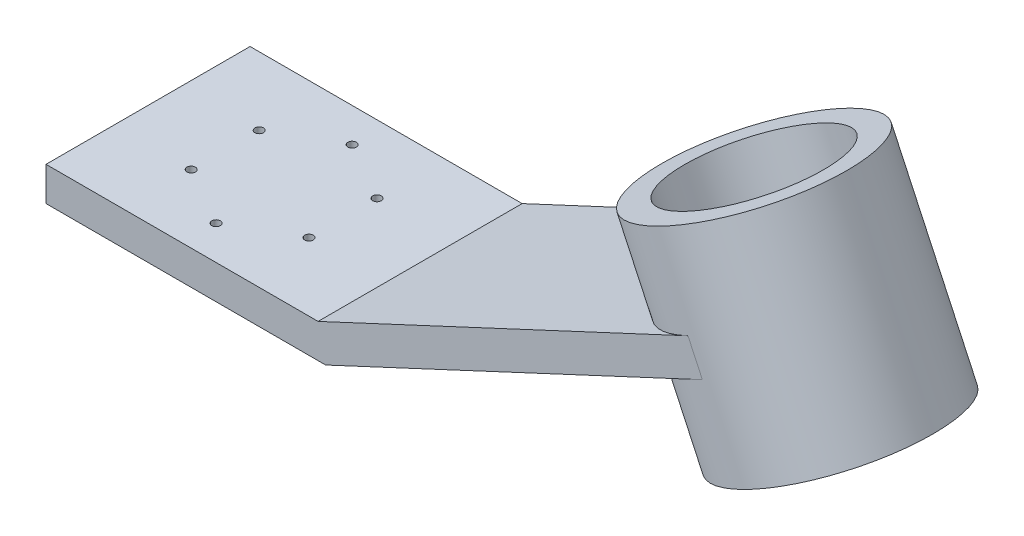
ISO-10303-21;
HEADER;
FILE_DESCRIPTION(('STEP AP214'),'2;1');
FILE_NAME('part.step','',(''),(''),'','','');
FILE_SCHEMA(('AUTOMOTIVE_DESIGN { 1 0 10303 214 1 1 1 1 }'));
ENDSEC;
DATA;
#1=APPLICATION_CONTEXT('core data for automotive mechanical design processes');
#2=APPLICATION_PROTOCOL_DEFINITION('international standard','automotive_design',2000,#1);
#3=PRODUCT_CONTEXT('',#1,'mechanical');
#4=PRODUCT('Part','Part','',(#3));
#5=PRODUCT_RELATED_PRODUCT_CATEGORY('part','',(#4));
#6=PRODUCT_DEFINITION_FORMATION('','',#4);
#7=PRODUCT_DEFINITION_CONTEXT('part definition',#1,'design');
#8=PRODUCT_DEFINITION('design','',#6,#7);
#9=PRODUCT_DEFINITION_SHAPE('','',#8);
#10=(LENGTH_UNIT() NAMED_UNIT(*) SI_UNIT(.MILLI.,.METRE.));
#11=(NAMED_UNIT(*) PLANE_ANGLE_UNIT() SI_UNIT($,.RADIAN.));
#12=(NAMED_UNIT(*) SI_UNIT($,.STERADIAN.) SOLID_ANGLE_UNIT());
#13=UNCERTAINTY_MEASURE_WITH_UNIT(LENGTH_MEASURE(1.E-05),#10,'distance_accuracy_value','');
#14=(GEOMETRIC_REPRESENTATION_CONTEXT(3) GLOBAL_UNCERTAINTY_ASSIGNED_CONTEXT((#13)) GLOBAL_UNIT_ASSIGNED_CONTEXT((#10,
#11,#12)) REPRESENTATION_CONTEXT('',''));
#15=CARTESIAN_POINT('',(0.,0.,0.));
#16=DIRECTION('',(0.,0.,1.));
#17=DIRECTION('',(1.,0.,0.));
#18=AXIS2_PLACEMENT_3D('',#15,#16,#17);
#19=CARTESIAN_POINT('',(4.22618261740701,-9.06307787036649,30.));
#20=DIRECTION('',(-0.422618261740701,0.906307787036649,0.));
#21=DIRECTION('',(-0.906307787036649,-0.422618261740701,0.));
#22=AXIS2_PLACEMENT_3D('',#19,#20,#21);
#23=PLANE('',#22);
#24=DIRECTION('',(0.906307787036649,0.422618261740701,0.));
#25=VECTOR('',#24,1.);
#26=CARTESIAN_POINT('',(4.22618261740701,-9.06307787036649,-30.));
#27=LINE('',#26,#25);
#28=CARTESIAN_POINT('',(2.21694662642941,-10.,-30.));
#29=VERTEX_POINT('',#28);
#30=CARTESIAN_POINT('',(112.983117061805,41.6511135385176,-30.));
#31=VERTEX_POINT('',#30);
#32=EDGE_CURVE('E174',#29,#31,#27,.T.);
#33=ORIENTED_EDGE('',*,*,#32,.T.);
#34=CARTESIAN_POINT('',(112.983117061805,41.6511135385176,0.));
#35=DIRECTION('',(-0.422618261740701,0.906307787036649,0.));
#36=DIRECTION('',(-0.906307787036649,-0.422618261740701,0.));
#37=AXIS2_PLACEMENT_3D('',#34,#35,#36);
#38=CIRCLE('',#37,30.);
#39=CARTESIAN_POINT('',(112.983117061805,41.6511135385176,30.));
#40=VERTEX_POINT('',#39);
#41=EDGE_CURVE('E171',#31,#40,#38,.T.);
#42=ORIENTED_EDGE('',*,*,#41,.T.);
#43=DIRECTION('',(0.906307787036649,0.422618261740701,0.));
#44=VECTOR('',#43,1.);
#45=CARTESIAN_POINT('',(4.22618261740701,-9.06307787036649,30.));
#46=LINE('',#45,#44);
#47=CARTESIAN_POINT('',(2.21694662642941,-10.,30.));
#48=VERTEX_POINT('',#47);
#49=EDGE_CURVE('E175',#48,#40,#46,.T.);
#50=ORIENTED_EDGE('',*,*,#49,.F.);
#51=DIRECTION('',(0.,0.,-1.));
#52=VECTOR('',#51,1.);
#53=CARTESIAN_POINT('',(2.21694662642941,-10.,30.));
#54=LINE('',#53,#52);
#55=EDGE_CURVE('E188',#48,#29,#54,.T.);
#56=ORIENTED_EDGE('',*,*,#55,.T.);
#57=EDGE_LOOP('',(#33,#42,#50,#56));
#58=FACE_BOUND('',#57,.T.);
#59=ADVANCED_FACE('F38',(#58),#23,.F.);
#60=CARTESIAN_POINT('',(0.,0.,30.));
#61=DIRECTION('',(-0.422618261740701,0.906307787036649,0.));
#62=DIRECTION('',(-0.906307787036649,-0.422618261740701,0.));
#63=AXIS2_PLACEMENT_3D('',#60,#61,#62);
#64=PLANE('',#63);
#65=CARTESIAN_POINT('',(108.756934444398,50.7141914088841,0.));
#66=DIRECTION('',(-0.422618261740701,0.906307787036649,0.));
#67=DIRECTION('',(-0.906307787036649,-0.422618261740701,0.));
#68=AXIS2_PLACEMENT_3D('',#65,#66,#67);
#69=CIRCLE('',#68,30.);
#70=CARTESIAN_POINT('',(108.756934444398,50.7141914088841,-30.));
#71=VERTEX_POINT('',#70);
#72=CARTESIAN_POINT('',(108.756934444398,50.7141914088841,30.));
#73=VERTEX_POINT('',#72);
#74=EDGE_CURVE('E169',#71,#73,#69,.T.);
#75=ORIENTED_EDGE('',*,*,#74,.F.);
#76=DIRECTION('',(0.906307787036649,0.422618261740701,0.));
#77=VECTOR('',#76,1.);
#78=CARTESIAN_POINT('',(0.,0.,-30.));
#79=LINE('',#78,#77);
#80=CARTESIAN_POINT('',(0.,0.,-30.));
#81=VERTEX_POINT('',#80);
#82=EDGE_CURVE('E194',#81,#71,#79,.T.);
#83=ORIENTED_EDGE('',*,*,#82,.F.);
#84=DIRECTION('',(0.,0.,-1.));
#85=VECTOR('',#84,1.);
#86=CARTESIAN_POINT('',(0.,0.,30.));
#87=LINE('',#86,#85);
#88=CARTESIAN_POINT('',(0.,0.,30.));
#89=VERTEX_POINT('',#88);
#90=EDGE_CURVE('E11',#89,#81,#87,.T.);
#91=ORIENTED_EDGE('',*,*,#90,.F.);
#92=DIRECTION('',(0.906307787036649,0.422618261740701,0.));
#93=VECTOR('',#92,1.);
#94=CARTESIAN_POINT('',(0.,0.,30.));
#95=LINE('',#94,#93);
#96=EDGE_CURVE('E179',#89,#73,#95,.T.);
#97=ORIENTED_EDGE('',*,*,#96,.T.);
#98=EDGE_LOOP('',(#75,#83,#91,#97));
#99=FACE_BOUND('',#98,.T.);
#100=ADVANCED_FACE('F221',(#99),#64,.T.);
#101=CARTESIAN_POINT('',(0.,0.,30.));
#102=DIRECTION('',(0.,1.,0.));
#103=DIRECTION('',(0.,0.,1.));
#104=AXIS2_PLACEMENT_3D('',#101,#102,#103);
#105=PLANE('',#104);
#106=CARTESIAN_POINT('',(-22.6794919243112,0.,-9.99999999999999));
#107=DIRECTION('',(0.,1.,0.));
#108=DIRECTION('',(0.,0.,1.));
#109=AXIS2_PLACEMENT_3D('',#106,#107,#108);
#110=CIRCLE('',#109,1.24999999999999);
#111=CARTESIAN_POINT('',(-22.6794919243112,0.,-8.75));
#112=VERTEX_POINT('',#111);
#113=EDGE_CURVE('E123',#112,#112,#110,.T.);
#114=ORIENTED_EDGE('',*,*,#113,.F.);
#115=EDGE_LOOP('',(#114));
#116=FACE_BOUND('',#115,.T.);
#117=CARTESIAN_POINT('',(-22.6794919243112,0.,10.));
#118=DIRECTION('',(0.,1.,0.));
#119=DIRECTION('',(0.,0.,1.));
#120=AXIS2_PLACEMENT_3D('',#117,#118,#119);
#121=CIRCLE('',#120,1.24999999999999);
#122=CARTESIAN_POINT('',(-22.6794919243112,0.,11.25));
#123=VERTEX_POINT('',#122);
#124=EDGE_CURVE('E122',#123,#123,#121,.T.);
#125=ORIENTED_EDGE('',*,*,#124,.F.);
#126=EDGE_LOOP('',(#125));
#127=FACE_BOUND('',#126,.T.);
#128=CARTESIAN_POINT('',(-40.,0.,20.));
#129=DIRECTION('',(0.,1.,0.));
#130=DIRECTION('',(0.,0.,1.));
#131=AXIS2_PLACEMENT_3D('',#128,#129,#130);
#132=CIRCLE('',#131,1.24999999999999);
#133=CARTESIAN_POINT('',(-40.,0.,21.25));
#134=VERTEX_POINT('',#133);
#135=EDGE_CURVE('E133',#134,#134,#132,.T.);
#136=ORIENTED_EDGE('',*,*,#135,.F.);
#137=EDGE_LOOP('',(#136));
#138=FACE_BOUND('',#137,.T.);
#139=CARTESIAN_POINT('',(-57.3205080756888,0.,9.99999999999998));
#140=DIRECTION('',(0.,1.,0.));
#141=DIRECTION('',(0.,0.,1.));
#142=AXIS2_PLACEMENT_3D('',#139,#140,#141);
#143=CIRCLE('',#142,1.24999999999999);
#144=CARTESIAN_POINT('',(-57.3205080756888,0.,11.25));
#145=VERTEX_POINT('',#144);
#146=EDGE_CURVE('E139',#145,#145,#143,.T.);
#147=ORIENTED_EDGE('',*,*,#146,.F.);
#148=EDGE_LOOP('',(#147));
#149=FACE_BOUND('',#148,.T.);
#150=CARTESIAN_POINT('',(-57.3205080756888,0.,-10.));
#151=DIRECTION('',(0.,1.,0.));
#152=DIRECTION('',(0.,0.,1.));
#153=AXIS2_PLACEMENT_3D('',#150,#151,#152);
#154=CIRCLE('',#153,1.24999999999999);
#155=CARTESIAN_POINT('',(-57.3205080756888,0.,-8.75000000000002));
#156=VERTEX_POINT('',#155);
#157=EDGE_CURVE('E145',#156,#156,#154,.T.);
#158=ORIENTED_EDGE('',*,*,#157,.F.);
#159=EDGE_LOOP('',(#158));
#160=FACE_BOUND('',#159,.T.);
#161=CARTESIAN_POINT('',(-40.,0.,-20.));
#162=DIRECTION('',(0.,1.,0.));
#163=DIRECTION('',(0.,0.,1.));
#164=AXIS2_PLACEMENT_3D('',#161,#162,#163);
#165=CIRCLE('',#164,1.24999999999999);
#166=CARTESIAN_POINT('',(-40.,0.,-18.75));
#167=VERTEX_POINT('',#166);
#168=EDGE_CURVE('E151',#167,#167,#165,.T.);
#169=ORIENTED_EDGE('',*,*,#168,.F.);
#170=EDGE_LOOP('',(#169));
#171=FACE_BOUND('',#170,.T.);
#172=DIRECTION('',(1.,0.,0.));
#173=VECTOR('',#172,1.);
#174=CARTESIAN_POINT('',(0.,0.,-30.));
#175=LINE('',#174,#173);
#176=CARTESIAN_POINT('',(-80.,0.,-30.));
#177=VERTEX_POINT('',#176);
#178=EDGE_CURVE('E197',#177,#81,#175,.T.);
#179=ORIENTED_EDGE('',*,*,#178,.F.);
#180=DIRECTION('',(0.,0.,-1.));
#181=VECTOR('',#180,1.);
#182=CARTESIAN_POINT('',(-80.,0.,30.));
#183=LINE('',#182,#181);
#184=CARTESIAN_POINT('',(-80.,0.,30.));
#185=VERTEX_POINT('',#184);
#186=EDGE_CURVE('E46',#185,#177,#183,.T.);
#187=ORIENTED_EDGE('',*,*,#186,.F.);
#188=DIRECTION('',(1.,0.,0.));
#189=VECTOR('',#188,1.);
#190=CARTESIAN_POINT('',(0.,0.,30.));
#191=LINE('',#190,#189);
#192=EDGE_CURVE('E181',#185,#89,#191,.T.);
#193=ORIENTED_EDGE('',*,*,#192,.T.);
#194=ORIENTED_EDGE('',*,*,#90,.T.);
#195=EDGE_LOOP('',(#179,#187,#193,#194));
#196=FACE_BOUND('',#195,.T.);
#197=ADVANCED_FACE('F211',(#116,#127,#138,#149,#160,#171,#196),#105,.T.);
#198=CARTESIAN_POINT('',(-80.,-10.,30.));
#199=DIRECTION('',(-1.,0.,0.));
#200=DIRECTION('',(0.,0.,1.));
#201=AXIS2_PLACEMENT_3D('',#198,#199,#200);
#202=PLANE('',#201);
#203=DIRECTION('',(0.,1.,0.));
#204=VECTOR('',#203,1.);
#205=CARTESIAN_POINT('',(-80.,-10.,-30.));
#206=LINE('',#205,#204);
#207=CARTESIAN_POINT('',(-80.,-10.,-30.));
#208=VERTEX_POINT('',#207);
#209=EDGE_CURVE('E200',#208,#177,#206,.T.);
#210=ORIENTED_EDGE('',*,*,#209,.F.);
#211=DIRECTION('',(0.,0.,-1.));
#212=VECTOR('',#211,1.);
#213=CARTESIAN_POINT('',(-80.,-10.,30.));
#214=LINE('',#213,#212);
#215=CARTESIAN_POINT('',(-80.,-10.,30.));
#216=VERTEX_POINT('',#215);
#217=EDGE_CURVE('E73',#216,#208,#214,.T.);
#218=ORIENTED_EDGE('',*,*,#217,.F.);
#219=DIRECTION('',(0.,1.,0.));
#220=VECTOR('',#219,1.);
#221=CARTESIAN_POINT('',(-80.,-10.,30.));
#222=LINE('',#221,#220);
#223=EDGE_CURVE('E184',#216,#185,#222,.T.);
#224=ORIENTED_EDGE('',*,*,#223,.T.);
#225=ORIENTED_EDGE('',*,*,#186,.T.);
#226=EDGE_LOOP('',(#210,#218,#224,#225));
#227=FACE_BOUND('',#226,.T.);
#228=ADVANCED_FACE('F208',(#227),#202,.T.);
#229=CARTESIAN_POINT('',(0.,-10.,30.));
#230=DIRECTION('',(0.,1.,0.));
#231=DIRECTION('',(0.,0.,1.));
#232=AXIS2_PLACEMENT_3D('',#229,#230,#231);
#233=PLANE('',#232);
#234=DIRECTION('',(1.,0.,0.));
#235=VECTOR('',#234,1.);
#236=CARTESIAN_POINT('',(0.,-10.,-30.));
#237=LINE('',#236,#235);
#238=EDGE_CURVE('E76',#208,#29,#237,.T.);
#239=ORIENTED_EDGE('',*,*,#238,.T.);
#240=ORIENTED_EDGE('',*,*,#55,.F.);
#241=DIRECTION('',(1.,0.,0.));
#242=VECTOR('',#241,1.);
#243=CARTESIAN_POINT('',(0.,-10.,30.));
#244=LINE('',#243,#242);
#245=EDGE_CURVE('E54',#216,#48,#244,.T.);
#246=ORIENTED_EDGE('',*,*,#245,.F.);
#247=ORIENTED_EDGE('',*,*,#217,.T.);
#248=EDGE_LOOP('',(#239,#240,#246,#247));
#249=FACE_BOUND('',#248,.T.);
#250=ADVANCED_FACE('F217',(#249),#233,.F.);
#251=CARTESIAN_POINT('',(0.,0.,30.));
#252=DIRECTION('',(0.,0.,-1.));
#253=DIRECTION('',(-1.,0.,0.));
#254=AXIS2_PLACEMENT_3D('',#251,#252,#253);
#255=PLANE('',#254);
#256=ORIENTED_EDGE('',*,*,#49,.T.);
#257=DIRECTION('',(0.422618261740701,-0.906307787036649,0.));
#258=VECTOR('',#257,1.);
#259=CARTESIAN_POINT('',(108.756934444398,50.7141914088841,30.));
#260=LINE('',#259,#258);
#261=EDGE_CURVE('E177',#73,#40,#260,.T.);
#262=ORIENTED_EDGE('',*,*,#261,.F.);
#263=ORIENTED_EDGE('',*,*,#96,.F.);
#264=ORIENTED_EDGE('',*,*,#192,.F.);
#265=ORIENTED_EDGE('',*,*,#223,.F.);
#266=ORIENTED_EDGE('',*,*,#245,.T.);
#267=EDGE_LOOP('',(#256,#262,#263,#264,#265,#266));
#268=FACE_BOUND('',#267,.T.);
#269=ADVANCED_FACE('F218',(#268),#255,.F.);
#270=CARTESIAN_POINT('',(0.,0.,-30.));
#271=DIRECTION('',(0.,0.,-1.));
#272=DIRECTION('',(-1.,0.,0.));
#273=AXIS2_PLACEMENT_3D('',#270,#271,#272);
#274=PLANE('',#273);
#275=ORIENTED_EDGE('',*,*,#32,.F.);
#276=ORIENTED_EDGE('',*,*,#238,.F.);
#277=ORIENTED_EDGE('',*,*,#209,.T.);
#278=ORIENTED_EDGE('',*,*,#178,.T.);
#279=ORIENTED_EDGE('',*,*,#82,.T.);
#280=DIRECTION('',(0.422618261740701,-0.906307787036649,0.));
#281=VECTOR('',#280,1.);
#282=CARTESIAN_POINT('',(108.756934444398,50.7141914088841,-30.));
#283=LINE('',#282,#281);
#284=EDGE_CURVE('E191',#71,#31,#283,.T.);
#285=ORIENTED_EDGE('',*,*,#284,.T.);
#286=EDGE_LOOP('',(#275,#276,#277,#278,#279,#285));
#287=FACE_BOUND('',#286,.T.);
#288=ADVANCED_FACE('F214',(#287),#274,.T.);
#289=CARTESIAN_POINT('',(123.548573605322,18.9934188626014,0.));
#290=DIRECTION('',(-0.422618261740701,0.906307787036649,0.));
#291=DIRECTION('',(-0.906307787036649,-0.422618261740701,0.));
#292=AXIS2_PLACEMENT_3D('',#289,#290,#291);
#293=CYLINDRICAL_SURFACE('',#292,30.);
#294=CARTESIAN_POINT('',(98.1914779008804,73.3718860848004,0.));
#295=DIRECTION('',(-0.422618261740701,0.906307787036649,0.));
#296=DIRECTION('',(-0.906307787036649,-0.422618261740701,0.));
#297=AXIS2_PLACEMENT_3D('',#294,#295,#296);
#298=CIRCLE('',#297,30.);
#299=CARTESIAN_POINT('',(71.0022442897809,60.6933382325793,0.));
#300=VERTEX_POINT('',#299);
#301=EDGE_CURVE('E163',#300,#300,#298,.T.);
#302=ORIENTED_EDGE('',*,*,#301,.F.);
#303=EDGE_LOOP('',(#302));
#304=FACE_BOUND('',#303,.T.);
#305=CARTESIAN_POINT('',(123.548573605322,18.9934188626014,0.));
#306=DIRECTION('',(-0.422618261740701,0.906307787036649,0.));
#307=DIRECTION('',(-0.906307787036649,-0.422618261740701,0.));
#308=AXIS2_PLACEMENT_3D('',#305,#306,#307);
#309=CIRCLE('',#308,30.);
#310=CARTESIAN_POINT('',(96.359339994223,6.31487101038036,0.));
#311=VERTEX_POINT('',#310);
#312=EDGE_CURVE('E166',#311,#311,#309,.T.);
#313=ORIENTED_EDGE('',*,*,#312,.T.);
#314=EDGE_LOOP('',(#313));
#315=FACE_BOUND('',#314,.T.);
#316=ORIENTED_EDGE('',*,*,#41,.F.);
#317=ORIENTED_EDGE('',*,*,#284,.F.);
#318=ORIENTED_EDGE('',*,*,#74,.T.);
#319=ORIENTED_EDGE('',*,*,#261,.T.);
#320=EDGE_LOOP('',(#316,#317,#318,#319));
#321=FACE_BOUND('',#320,.T.);
#322=ADVANCED_FACE('F223',(#304,#315,#321),#293,.T.);
#323=CARTESIAN_POINT('',(123.548573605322,18.9934188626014,0.));
#324=DIRECTION('',(-0.422618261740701,0.906307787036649,0.));
#325=DIRECTION('',(-0.906307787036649,-0.422618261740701,0.));
#326=AXIS2_PLACEMENT_3D('',#323,#324,#325);
#327=PLANE('',#326);
#328=CARTESIAN_POINT('',(123.548573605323,18.9934188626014,0.));
#329=DIRECTION('',(-0.422618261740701,0.906307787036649,0.));
#330=DIRECTION('',(-0.906307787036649,-0.422618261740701,0.));
#331=AXIS2_PLACEMENT_3D('',#328,#329,#330);
#332=CIRCLE('',#331,22.5);
#333=CARTESIAN_POINT('',(103.156648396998,9.48450797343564,0.));
#334=VERTEX_POINT('',#333);
#335=EDGE_CURVE('E160',#334,#334,#332,.T.);
#336=ORIENTED_EDGE('',*,*,#335,.T.);
#337=EDGE_LOOP('',(#336));
#338=FACE_BOUND('',#337,.T.);
#339=ORIENTED_EDGE('',*,*,#312,.F.);
#340=EDGE_LOOP('',(#339));
#341=FACE_BOUND('',#340,.T.);
#342=ADVANCED_FACE('F225',(#338,#341),#327,.F.);
#343=CARTESIAN_POINT('',(98.1914779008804,73.3718860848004,0.));
#344=DIRECTION('',(-0.422618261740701,0.906307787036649,0.));
#345=DIRECTION('',(-0.906307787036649,-0.422618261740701,0.));
#346=AXIS2_PLACEMENT_3D('',#343,#344,#345);
#347=PLANE('',#346);
#348=CARTESIAN_POINT('',(98.1914779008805,73.3718860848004,0.));
#349=DIRECTION('',(-0.422618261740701,0.906307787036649,0.));
#350=DIRECTION('',(-0.906307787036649,-0.422618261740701,0.));
#351=AXIS2_PLACEMENT_3D('',#348,#349,#350);
#352=CIRCLE('',#351,22.5);
#353=CARTESIAN_POINT('',(77.7995526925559,63.8629751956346,0.));
#354=VERTEX_POINT('',#353);
#355=EDGE_CURVE('E157',#354,#354,#352,.T.);
#356=ORIENTED_EDGE('',*,*,#355,.F.);
#357=EDGE_LOOP('',(#356));
#358=FACE_BOUND('',#357,.T.);
#359=ORIENTED_EDGE('',*,*,#301,.T.);
#360=EDGE_LOOP('',(#359));
#361=FACE_BOUND('',#360,.T.);
#362=ADVANCED_FACE('F232',(#358,#361),#347,.T.);
#363=CARTESIAN_POINT('',(139.509862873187,-15.2356764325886,0.));
#364=DIRECTION('',(-0.422618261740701,0.906307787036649,0.));
#365=DIRECTION('',(-0.906307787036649,-0.422618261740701,0.));
#366=AXIS2_PLACEMENT_3D('',#363,#364,#365);
#367=CYLINDRICAL_SURFACE('',#366,22.5);
#368=ORIENTED_EDGE('',*,*,#355,.T.);
#369=EDGE_LOOP('',(#368));
#370=FACE_BOUND('',#369,.T.);
#371=ORIENTED_EDGE('',*,*,#335,.F.);
#372=EDGE_LOOP('',(#371));
#373=FACE_BOUND('',#372,.T.);
#374=ADVANCED_FACE('F280',(#370,#373),#367,.F.);
#375=CARTESIAN_POINT('',(-40.,-8.49999999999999,-20.));
#376=DIRECTION('',(0.,1.,0.));
#377=DIRECTION('',(0.,0.,1.));
#378=AXIS2_PLACEMENT_3D('',#375,#376,#377);
#379=CONICAL_SURFACE('',#378,1.24999999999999,1.02974425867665);
#380=CARTESIAN_POINT('',(-40.,-9.25107577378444,-20.));
#381=VERTEX_POINT('',#380);
#382=VERTEX_LOOP('',#381);
#383=FACE_BOUND('',#382,.T.);
#384=CARTESIAN_POINT('',(-40.,-8.49999999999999,-20.));
#385=DIRECTION('',(0.,1.,0.));
#386=DIRECTION('',(0.,0.,1.));
#387=AXIS2_PLACEMENT_3D('',#384,#385,#386);
#388=CIRCLE('',#387,1.24999999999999);
#389=CARTESIAN_POINT('',(-40.,-8.49999999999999,-18.75));
#390=VERTEX_POINT('',#389);
#391=EDGE_CURVE('E154',#390,#390,#388,.T.);
#392=ORIENTED_EDGE('',*,*,#391,.T.);
#393=EDGE_LOOP('',(#392));
#394=FACE_BOUND('',#393,.T.);
#395=ADVANCED_FACE('F290',(#383,#394),#379,.F.);
#396=CARTESIAN_POINT('',(-40.,0.,-20.));
#397=DIRECTION('',(0.,1.,0.));
#398=DIRECTION('',(0.,0.,1.));
#399=AXIS2_PLACEMENT_3D('',#396,#397,#398);
#400=CYLINDRICAL_SURFACE('',#399,1.24999999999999);
#401=ORIENTED_EDGE('',*,*,#391,.F.);
#402=EDGE_LOOP('',(#401));
#403=FACE_BOUND('',#402,.T.);
#404=ORIENTED_EDGE('',*,*,#168,.T.);
#405=EDGE_LOOP('',(#404));
#406=FACE_BOUND('',#405,.T.);
#407=ADVANCED_FACE('F300',(#403,#406),#400,.F.);
#408=CARTESIAN_POINT('',(-57.3205080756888,-8.49999999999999,-10.));
#409=DIRECTION('',(0.,1.,0.));
#410=DIRECTION('',(0.,0.,1.));
#411=AXIS2_PLACEMENT_3D('',#408,#409,#410);
#412=CONICAL_SURFACE('',#411,1.24999999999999,1.02974425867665);
#413=CARTESIAN_POINT('',(-57.3205080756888,-9.25107577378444,-10.));
#414=VERTEX_POINT('',#413);
#415=VERTEX_LOOP('',#414);
#416=FACE_BOUND('',#415,.T.);
#417=CARTESIAN_POINT('',(-57.3205080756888,-8.49999999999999,-10.));
#418=DIRECTION('',(0.,1.,0.));
#419=DIRECTION('',(0.,0.,1.));
#420=AXIS2_PLACEMENT_3D('',#417,#418,#419);
#421=CIRCLE('',#420,1.24999999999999);
#422=CARTESIAN_POINT('',(-57.3205080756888,-8.49999999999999,-8.75000000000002));
#423=VERTEX_POINT('',#422);
#424=EDGE_CURVE('E148',#423,#423,#421,.T.);
#425=ORIENTED_EDGE('',*,*,#424,.T.);
#426=EDGE_LOOP('',(#425));
#427=FACE_BOUND('',#426,.T.);
#428=ADVANCED_FACE('F311',(#416,#427),#412,.F.);
#429=CARTESIAN_POINT('',(-57.3205080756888,0.,-10.));
#430=DIRECTION('',(0.,1.,0.));
#431=DIRECTION('',(0.,0.,1.));
#432=AXIS2_PLACEMENT_3D('',#429,#430,#431);
#433=CYLINDRICAL_SURFACE('',#432,1.24999999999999);
#434=ORIENTED_EDGE('',*,*,#424,.F.);
#435=EDGE_LOOP('',(#434));
#436=FACE_BOUND('',#435,.T.);
#437=ORIENTED_EDGE('',*,*,#157,.T.);
#438=EDGE_LOOP('',(#437));
#439=FACE_BOUND('',#438,.T.);
#440=ADVANCED_FACE('F330',(#436,#439),#433,.F.);
#441=CARTESIAN_POINT('',(-57.3205080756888,-8.49999999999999,9.99999999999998));
#442=DIRECTION('',(0.,1.,0.));
#443=DIRECTION('',(0.,0.,1.));
#444=AXIS2_PLACEMENT_3D('',#441,#442,#443);
#445=CONICAL_SURFACE('',#444,1.24999999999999,1.02974425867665);
#446=CARTESIAN_POINT('',(-57.3205080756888,-9.25107577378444,9.99999999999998));
#447=VERTEX_POINT('',#446);
#448=VERTEX_LOOP('',#447);
#449=FACE_BOUND('',#448,.T.);
#450=CARTESIAN_POINT('',(-57.3205080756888,-8.49999999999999,9.99999999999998));
#451=DIRECTION('',(0.,1.,0.));
#452=DIRECTION('',(0.,0.,1.));
#453=AXIS2_PLACEMENT_3D('',#450,#451,#452);
#454=CIRCLE('',#453,1.24999999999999);
#455=CARTESIAN_POINT('',(-57.3205080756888,-8.49999999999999,11.25));
#456=VERTEX_POINT('',#455);
#457=EDGE_CURVE('E142',#456,#456,#454,.T.);
#458=ORIENTED_EDGE('',*,*,#457,.T.);
#459=EDGE_LOOP('',(#458));
#460=FACE_BOUND('',#459,.T.);
#461=ADVANCED_FACE('F341',(#449,#460),#445,.F.);
#462=CARTESIAN_POINT('',(-57.3205080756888,0.,9.99999999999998));
#463=DIRECTION('',(0.,1.,0.));
#464=DIRECTION('',(0.,0.,1.));
#465=AXIS2_PLACEMENT_3D('',#462,#463,#464);
#466=CYLINDRICAL_SURFACE('',#465,1.24999999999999);
#467=ORIENTED_EDGE('',*,*,#457,.F.);
#468=EDGE_LOOP('',(#467));
#469=FACE_BOUND('',#468,.T.);
#470=ORIENTED_EDGE('',*,*,#146,.T.);
#471=EDGE_LOOP('',(#470));
#472=FACE_BOUND('',#471,.T.);
#473=ADVANCED_FACE('F352',(#469,#472),#466,.F.);
#474=CARTESIAN_POINT('',(-40.,-8.49999999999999,20.));
#475=DIRECTION('',(0.,1.,0.));
#476=DIRECTION('',(0.,0.,1.));
#477=AXIS2_PLACEMENT_3D('',#474,#475,#476);
#478=CONICAL_SURFACE('',#477,1.24999999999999,1.02974425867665);
#479=CARTESIAN_POINT('',(-40.,-9.25107577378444,20.));
#480=VERTEX_POINT('',#479);
#481=VERTEX_LOOP('',#480);
#482=FACE_BOUND('',#481,.T.);
#483=CARTESIAN_POINT('',(-40.,-8.49999999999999,20.));
#484=DIRECTION('',(0.,1.,0.));
#485=DIRECTION('',(0.,0.,1.));
#486=AXIS2_PLACEMENT_3D('',#483,#484,#485);
#487=CIRCLE('',#486,1.24999999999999);
#488=CARTESIAN_POINT('',(-40.,-8.49999999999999,21.25));
#489=VERTEX_POINT('',#488);
#490=EDGE_CURVE('E136',#489,#489,#487,.T.);
#491=ORIENTED_EDGE('',*,*,#490,.T.);
#492=EDGE_LOOP('',(#491));
#493=FACE_BOUND('',#492,.T.);
#494=ADVANCED_FACE('F363',(#482,#493),#478,.F.);
#495=CARTESIAN_POINT('',(-40.,0.,20.));
#496=DIRECTION('',(0.,1.,0.));
#497=DIRECTION('',(0.,0.,1.));
#498=AXIS2_PLACEMENT_3D('',#495,#496,#497);
#499=CYLINDRICAL_SURFACE('',#498,1.24999999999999);
#500=ORIENTED_EDGE('',*,*,#490,.F.);
#501=EDGE_LOOP('',(#500));
#502=FACE_BOUND('',#501,.T.);
#503=ORIENTED_EDGE('',*,*,#135,.T.);
#504=EDGE_LOOP('',(#503));
#505=FACE_BOUND('',#504,.T.);
#506=ADVANCED_FACE('F375',(#502,#505),#499,.F.);
#507=CARTESIAN_POINT('',(-22.6794919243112,-8.49999999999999,10.));
#508=DIRECTION('',(0.,1.,0.));
#509=DIRECTION('',(0.,0.,1.));
#510=AXIS2_PLACEMENT_3D('',#507,#508,#509);
#511=CONICAL_SURFACE('',#510,1.24999999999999,1.02974425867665);
#512=CARTESIAN_POINT('',(-22.6794919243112,-9.25107577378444,10.));
#513=VERTEX_POINT('',#512);
#514=VERTEX_LOOP('',#513);
#515=FACE_BOUND('',#514,.T.);
#516=CARTESIAN_POINT('',(-22.6794919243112,-8.49999999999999,10.));
#517=DIRECTION('',(0.,1.,0.));
#518=DIRECTION('',(0.,0.,1.));
#519=AXIS2_PLACEMENT_3D('',#516,#517,#518);
#520=CIRCLE('',#519,1.24999999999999);
#521=CARTESIAN_POINT('',(-22.6794919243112,-8.49999999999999,11.25));
#522=VERTEX_POINT('',#521);
#523=EDGE_CURVE('E126',#522,#522,#520,.T.);
#524=ORIENTED_EDGE('',*,*,#523,.T.);
#525=EDGE_LOOP('',(#524));
#526=FACE_BOUND('',#525,.T.);
#527=ADVANCED_FACE('F385',(#515,#526),#511,.F.);
#528=CARTESIAN_POINT('',(-22.6794919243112,0.,10.));
#529=DIRECTION('',(0.,1.,0.));
#530=DIRECTION('',(0.,0.,1.));
#531=AXIS2_PLACEMENT_3D('',#528,#529,#530);
#532=CYLINDRICAL_SURFACE('',#531,1.24999999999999);
#533=ORIENTED_EDGE('',*,*,#523,.F.);
#534=EDGE_LOOP('',(#533));
#535=FACE_BOUND('',#534,.T.);
#536=ORIENTED_EDGE('',*,*,#124,.T.);
#537=EDGE_LOOP('',(#536));
#538=FACE_BOUND('',#537,.T.);
#539=ADVANCED_FACE('F116',(#535,#538),#532,.F.);
#540=CARTESIAN_POINT('',(-22.6794919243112,-8.49999999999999,-9.99999999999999));
#541=DIRECTION('',(0.,1.,0.));
#542=DIRECTION('',(0.,0.,1.));
#543=AXIS2_PLACEMENT_3D('',#540,#541,#542);
#544=CONICAL_SURFACE('',#543,1.24999999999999,1.02974425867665);
#545=CARTESIAN_POINT('',(-22.6794919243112,-9.25107577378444,-9.99999999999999));
#546=VERTEX_POINT('',#545);
#547=VERTEX_LOOP('',#546);
#548=FACE_BOUND('',#547,.T.);
#549=CARTESIAN_POINT('',(-22.6794919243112,-8.49999999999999,-9.99999999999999));
#550=DIRECTION('',(0.,1.,0.));
#551=DIRECTION('',(0.,0.,1.));
#552=AXIS2_PLACEMENT_3D('',#549,#550,#551);
#553=CIRCLE('',#552,1.24999999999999);
#554=CARTESIAN_POINT('',(-22.6794919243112,-8.49999999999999,-8.75));
#555=VERTEX_POINT('',#554);
#556=EDGE_CURVE('E120',#555,#555,#553,.T.);
#557=ORIENTED_EDGE('',*,*,#556,.T.);
#558=EDGE_LOOP('',(#557));
#559=FACE_BOUND('',#558,.T.);
#560=ADVANCED_FACE('F112',(#548,#559),#544,.F.);
#561=CARTESIAN_POINT('',(-22.6794919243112,0.,-9.99999999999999));
#562=DIRECTION('',(0.,1.,0.));
#563=DIRECTION('',(0.,0.,1.));
#564=AXIS2_PLACEMENT_3D('',#561,#562,#563);
#565=CYLINDRICAL_SURFACE('',#564,1.24999999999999);
#566=ORIENTED_EDGE('',*,*,#556,.F.);
#567=EDGE_LOOP('',(#566));
#568=FACE_BOUND('',#567,.T.);
#569=ORIENTED_EDGE('',*,*,#113,.T.);
#570=EDGE_LOOP('',(#569));
#571=FACE_BOUND('',#570,.T.);
#572=ADVANCED_FACE('F115',(#568,#571),#565,.F.);
#573=CLOSED_SHELL('',(#59,#100,#197,#228,#250,#269,#288,#322,#342,#362,#374,#395,#407,#428,#440,
#461,#473,#494,#506,#527,#539,#560,#572));
#574=MANIFOLD_SOLID_BREP('B2',#573);
#575=ADVANCED_BREP_SHAPE_REPRESENTATION('',(#18,#574),#14);
#576=SHAPE_DEFINITION_REPRESENTATION(#9,#575);
ENDSEC;
END-ISO-10303-21;
